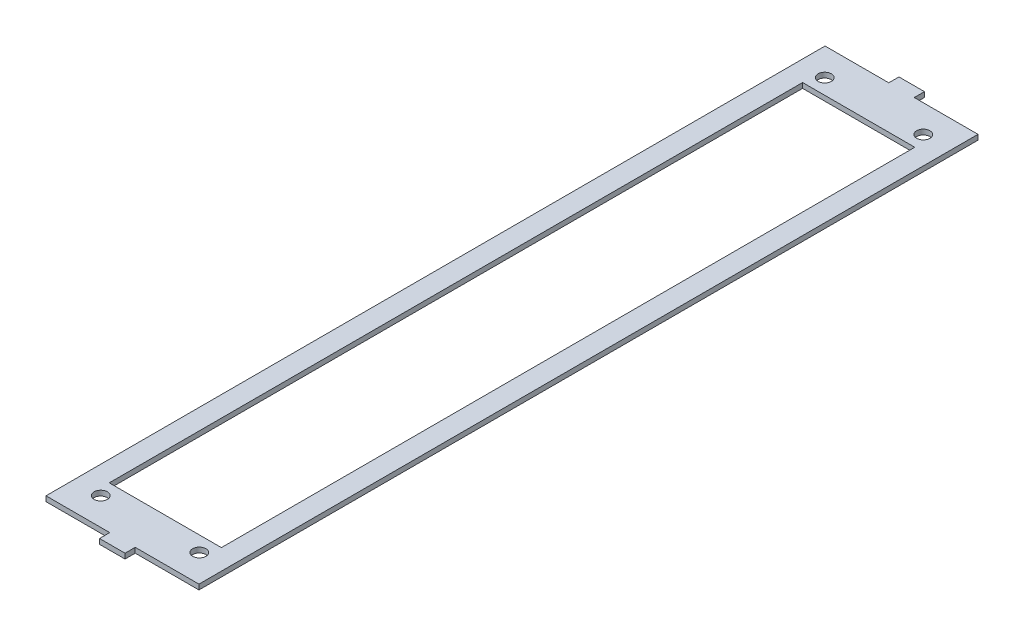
ISO-10303-21;
HEADER;
FILE_DESCRIPTION(('STEP AP214'),'2;1');
FILE_NAME('part.step','',(''),(''),'','','');
FILE_SCHEMA(('AUTOMOTIVE_DESIGN { 1 0 10303 214 1 1 1 1 }'));
ENDSEC;
DATA;
#1=APPLICATION_CONTEXT('core data for automotive mechanical design processes');
#2=APPLICATION_PROTOCOL_DEFINITION('international standard','automotive_design',2000,#1);
#3=PRODUCT_CONTEXT('',#1,'mechanical');
#4=PRODUCT('Part','Part','',(#3));
#5=PRODUCT_RELATED_PRODUCT_CATEGORY('part','',(#4));
#6=PRODUCT_DEFINITION_FORMATION('','',#4);
#7=PRODUCT_DEFINITION_CONTEXT('part definition',#1,'design');
#8=PRODUCT_DEFINITION('design','',#6,#7);
#9=PRODUCT_DEFINITION_SHAPE('','',#8);
#10=(LENGTH_UNIT() NAMED_UNIT(*) SI_UNIT(.MILLI.,.METRE.));
#11=(NAMED_UNIT(*) PLANE_ANGLE_UNIT() SI_UNIT($,.RADIAN.));
#12=(NAMED_UNIT(*) SI_UNIT($,.STERADIAN.) SOLID_ANGLE_UNIT());
#13=UNCERTAINTY_MEASURE_WITH_UNIT(LENGTH_MEASURE(1.E-05),#10,'distance_accuracy_value','');
#14=(GEOMETRIC_REPRESENTATION_CONTEXT(3) GLOBAL_UNCERTAINTY_ASSIGNED_CONTEXT((#13)) GLOBAL_UNIT_ASSIGNED_CONTEXT((#10,
#11,#12)) REPRESENTATION_CONTEXT('',''));
#15=CARTESIAN_POINT('',(0.,0.,0.));
#16=DIRECTION('',(0.,0.,1.));
#17=DIRECTION('',(1.,0.,0.));
#18=AXIS2_PLACEMENT_3D('',#15,#16,#17);
#19=CARTESIAN_POINT('',(0.,3.,0.));
#20=DIRECTION('',(0.,1.,0.));
#21=DIRECTION('',(0.,0.,1.));
#22=AXIS2_PLACEMENT_3D('',#19,#20,#21);
#23=PLANE('',#22);
#24=CARTESIAN_POINT('',(61.9999999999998,3.,417.));
#25=DIRECTION('',(0.,1.,0.));
#26=DIRECTION('',(0.,0.,1.));
#27=AXIS2_PLACEMENT_3D('',#24,#25,#26);
#28=CIRCLE('',#27,3.89999999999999);
#29=CARTESIAN_POINT('',(61.9999999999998,3.,420.9));
#30=VERTEX_POINT('',#29);
#31=EDGE_CURVE('E525',#30,#30,#28,.T.);
#32=ORIENTED_EDGE('',*,*,#31,.F.);
#33=EDGE_LOOP('',(#32));
#34=FACE_BOUND('',#33,.T.);
#35=CARTESIAN_POINT('',(4.00000000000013,3.,-9.));
#36=DIRECTION('',(0.,1.,0.));
#37=DIRECTION('',(0.,0.,1.));
#38=AXIS2_PLACEMENT_3D('',#35,#36,#37);
#39=CIRCLE('',#38,3.9);
#40=CARTESIAN_POINT('',(4.00000000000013,3.,-5.1));
#41=VERTEX_POINT('',#40);
#42=EDGE_CURVE('E175',#41,#41,#39,.T.);
#43=ORIENTED_EDGE('',*,*,#42,.F.);
#44=EDGE_LOOP('',(#43));
#45=FACE_BOUND('',#44,.T.);
#46=DIRECTION('',(-1.,0.,0.));
#47=VECTOR('',#46,1.);
#48=CARTESIAN_POINT('',(40.5,3.,-25.2));
#49=LINE('',#48,#47);
#50=CARTESIAN_POINT('',(78.,3.,-25.2));
#51=VERTEX_POINT('',#50);
#52=CARTESIAN_POINT('',(40.5,3.,-25.2));
#53=VERTEX_POINT('',#52);
#54=EDGE_CURVE('E185',#51,#53,#49,.T.);
#55=ORIENTED_EDGE('',*,*,#54,.T.);
#56=DIRECTION('',(0.,0.,-1.));
#57=VECTOR('',#56,1.);
#58=CARTESIAN_POINT('',(40.5,3.,-31.2));
#59=LINE('',#58,#57);
#60=CARTESIAN_POINT('',(40.5,3.,-31.2));
#61=VERTEX_POINT('',#60);
#62=EDGE_CURVE('E188',#53,#61,#59,.T.);
#63=ORIENTED_EDGE('',*,*,#62,.T.);
#64=DIRECTION('',(-1.,0.,0.));
#65=VECTOR('',#64,1.);
#66=CARTESIAN_POINT('',(25.5,3.,-31.2));
#67=LINE('',#66,#65);
#68=CARTESIAN_POINT('',(25.5,3.,-31.2));
#69=VERTEX_POINT('',#68);
#70=EDGE_CURVE('E191',#61,#69,#67,.T.);
#71=ORIENTED_EDGE('',*,*,#70,.T.);
#72=DIRECTION('',(0.,0.,1.));
#73=VECTOR('',#72,1.);
#74=CARTESIAN_POINT('',(25.5,3.,-31.2));
#75=LINE('',#74,#73);
#76=CARTESIAN_POINT('',(25.5,3.,-25.2));
#77=VERTEX_POINT('',#76);
#78=EDGE_CURVE('E193',#69,#77,#75,.T.);
#79=ORIENTED_EDGE('',*,*,#78,.T.);
#80=DIRECTION('',(-1.,0.,0.));
#81=VECTOR('',#80,1.);
#82=CARTESIAN_POINT('',(-12.,3.,-25.2));
#83=LINE('',#82,#81);
#84=CARTESIAN_POINT('',(-12.,3.,-25.2));
#85=VERTEX_POINT('',#84);
#86=EDGE_CURVE('E195',#77,#85,#83,.T.);
#87=ORIENTED_EDGE('',*,*,#86,.T.);
#88=DIRECTION('',(0.,0.,1.));
#89=VECTOR('',#88,1.);
#90=CARTESIAN_POINT('',(-12.,3.,433.2));
#91=LINE('',#90,#89);
#92=CARTESIAN_POINT('',(-12.,3.,433.2));
#93=VERTEX_POINT('',#92);
#94=EDGE_CURVE('E197',#85,#93,#91,.T.);
#95=ORIENTED_EDGE('',*,*,#94,.T.);
#96=DIRECTION('',(1.,0.,0.));
#97=VECTOR('',#96,1.);
#98=CARTESIAN_POINT('',(-12.,3.,433.2));
#99=LINE('',#98,#97);
#100=CARTESIAN_POINT('',(25.5,3.,433.2));
#101=VERTEX_POINT('',#100);
#102=EDGE_CURVE('E199',#93,#101,#99,.T.);
#103=ORIENTED_EDGE('',*,*,#102,.T.);
#104=DIRECTION('',(0.,0.,1.));
#105=VECTOR('',#104,1.);
#106=CARTESIAN_POINT('',(25.5,3.,439.2));
#107=LINE('',#106,#105);
#108=CARTESIAN_POINT('',(25.5,3.,439.2));
#109=VERTEX_POINT('',#108);
#110=EDGE_CURVE('E201',#101,#109,#107,.T.);
#111=ORIENTED_EDGE('',*,*,#110,.T.);
#112=DIRECTION('',(1.,0.,0.));
#113=VECTOR('',#112,1.);
#114=CARTESIAN_POINT('',(25.5,3.,439.2));
#115=LINE('',#114,#113);
#116=CARTESIAN_POINT('',(40.5,3.,439.2));
#117=VERTEX_POINT('',#116);
#118=EDGE_CURVE('E203',#109,#117,#115,.T.);
#119=ORIENTED_EDGE('',*,*,#118,.T.);
#120=DIRECTION('',(0.,0.,-1.));
#121=VECTOR('',#120,1.);
#122=CARTESIAN_POINT('',(40.5,3.,439.2));
#123=LINE('',#122,#121);
#124=CARTESIAN_POINT('',(40.5,3.,433.2));
#125=VERTEX_POINT('',#124);
#126=EDGE_CURVE('E205',#117,#125,#123,.T.);
#127=ORIENTED_EDGE('',*,*,#126,.T.);
#128=DIRECTION('',(1.,0.,0.));
#129=VECTOR('',#128,1.);
#130=CARTESIAN_POINT('',(40.5,3.,433.2));
#131=LINE('',#130,#129);
#132=CARTESIAN_POINT('',(78.,3.,433.2));
#133=VERTEX_POINT('',#132);
#134=EDGE_CURVE('E207',#125,#133,#131,.T.);
#135=ORIENTED_EDGE('',*,*,#134,.T.);
#136=DIRECTION('',(0.,0.,-1.));
#137=VECTOR('',#136,1.);
#138=CARTESIAN_POINT('',(78.,3.,433.2));
#139=LINE('',#138,#137);
#140=EDGE_CURVE('E209',#133,#51,#139,.T.);
#141=ORIENTED_EDGE('',*,*,#140,.T.);
#142=EDGE_LOOP('',(#55,#63,#71,#79,#87,#95,#103,#111,#119,#127,#135,#141));
#143=FACE_BOUND('',#142,.T.);
#144=DIRECTION('',(1.,0.,0.));
#145=VECTOR('',#144,1.);
#146=CARTESIAN_POINT('',(0.,3.,408.));
#147=LINE('',#146,#145);
#148=CARTESIAN_POINT('',(0.,3.,408.));
#149=VERTEX_POINT('',#148);
#150=CARTESIAN_POINT('',(66.0000000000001,3.,408.));
#151=VERTEX_POINT('',#150);
#152=EDGE_CURVE('E154',#149,#151,#147,.T.);
#153=ORIENTED_EDGE('',*,*,#152,.F.);
#154=DIRECTION('',(0.,0.,1.));
#155=VECTOR('',#154,1.);
#156=CARTESIAN_POINT('',(0.,3.,0.));
#157=LINE('',#156,#155);
#158=CARTESIAN_POINT('',(0.,3.,0.));
#159=VERTEX_POINT('',#158);
#160=EDGE_CURVE('E146',#159,#149,#157,.T.);
#161=ORIENTED_EDGE('',*,*,#160,.F.);
#162=DIRECTION('',(-1.,0.,0.));
#163=VECTOR('',#162,1.);
#164=CARTESIAN_POINT('',(0.,3.,0.));
#165=LINE('',#164,#163);
#166=CARTESIAN_POINT('',(66.,3.,0.));
#167=VERTEX_POINT('',#166);
#168=EDGE_CURVE('E169',#167,#159,#165,.T.);
#169=ORIENTED_EDGE('',*,*,#168,.F.);
#170=DIRECTION('',(0.,0.,-1.));
#171=VECTOR('',#170,1.);
#172=CARTESIAN_POINT('',(66.,3.,0.));
#173=LINE('',#172,#171);
#174=EDGE_CURVE('E167',#151,#167,#173,.T.);
#175=ORIENTED_EDGE('',*,*,#174,.F.);
#176=EDGE_LOOP('',(#153,#161,#169,#175));
#177=FACE_BOUND('',#176,.T.);
#178=CARTESIAN_POINT('',(61.9999999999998,3.,-9.));
#179=DIRECTION('',(0.,1.,0.));
#180=DIRECTION('',(0.,0.,-1.));
#181=AXIS2_PLACEMENT_3D('',#178,#179,#180);
#182=CIRCLE('',#181,3.9);
#183=CARTESIAN_POINT('',(61.9999999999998,3.,-12.9));
#184=VERTEX_POINT('',#183);
#185=EDGE_CURVE('E531',#184,#184,#182,.T.);
#186=ORIENTED_EDGE('',*,*,#185,.F.);
#187=EDGE_LOOP('',(#186));
#188=FACE_BOUND('',#187,.T.);
#189=CARTESIAN_POINT('',(4.00000000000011,3.,417.));
#190=DIRECTION('',(0.,1.,0.));
#191=DIRECTION('',(0.,0.,-1.));
#192=AXIS2_PLACEMENT_3D('',#189,#190,#191);
#193=CIRCLE('',#192,3.89999999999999);
#194=CARTESIAN_POINT('',(4.00000000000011,3.,413.1));
#195=VERTEX_POINT('',#194);
#196=EDGE_CURVE('E516',#195,#195,#193,.T.);
#197=ORIENTED_EDGE('',*,*,#196,.F.);
#198=EDGE_LOOP('',(#197));
#199=FACE_BOUND('',#198,.T.);
#200=ADVANCED_FACE('F33',(#34,#45,#143,#177,#188,#199),#23,.T.);
#201=CARTESIAN_POINT('',(0.,0.,0.));
#202=DIRECTION('',(0.,1.,0.));
#203=DIRECTION('',(0.,0.,1.));
#204=AXIS2_PLACEMENT_3D('',#201,#202,#203);
#205=PLANE('',#204);
#206=DIRECTION('',(-1.,0.,0.));
#207=VECTOR('',#206,1.);
#208=CARTESIAN_POINT('',(40.5,0.,-25.2));
#209=LINE('',#208,#207);
#210=CARTESIAN_POINT('',(78.,0.,-25.2));
#211=VERTEX_POINT('',#210);
#212=CARTESIAN_POINT('',(40.5,0.,-25.2));
#213=VERTEX_POINT('',#212);
#214=EDGE_CURVE('E162',#211,#213,#209,.T.);
#215=ORIENTED_EDGE('',*,*,#214,.F.);
#216=DIRECTION('',(0.,0.,-1.));
#217=VECTOR('',#216,1.);
#218=CARTESIAN_POINT('',(78.,0.,433.2));
#219=LINE('',#218,#217);
#220=CARTESIAN_POINT('',(78.,0.,433.2));
#221=VERTEX_POINT('',#220);
#222=EDGE_CURVE('E189',#221,#211,#219,.T.);
#223=ORIENTED_EDGE('',*,*,#222,.F.);
#224=DIRECTION('',(1.,0.,0.));
#225=VECTOR('',#224,1.);
#226=CARTESIAN_POINT('',(40.5,0.,433.2));
#227=LINE('',#226,#225);
#228=CARTESIAN_POINT('',(40.5,0.,433.2));
#229=VERTEX_POINT('',#228);
#230=EDGE_CURVE('E232',#229,#221,#227,.T.);
#231=ORIENTED_EDGE('',*,*,#230,.F.);
#232=DIRECTION('',(0.,0.,-1.));
#233=VECTOR('',#232,1.);
#234=CARTESIAN_POINT('',(40.5,0.,439.2));
#235=LINE('',#234,#233);
#236=CARTESIAN_POINT('',(40.5,0.,439.2));
#237=VERTEX_POINT('',#236);
#238=EDGE_CURVE('E230',#237,#229,#235,.T.);
#239=ORIENTED_EDGE('',*,*,#238,.F.);
#240=DIRECTION('',(1.,0.,0.));
#241=VECTOR('',#240,1.);
#242=CARTESIAN_POINT('',(25.5,0.,439.2));
#243=LINE('',#242,#241);
#244=CARTESIAN_POINT('',(25.5,0.,439.2));
#245=VERTEX_POINT('',#244);
#246=EDGE_CURVE('E228',#245,#237,#243,.T.);
#247=ORIENTED_EDGE('',*,*,#246,.F.);
#248=DIRECTION('',(0.,0.,1.));
#249=VECTOR('',#248,1.);
#250=CARTESIAN_POINT('',(25.5,0.,439.2));
#251=LINE('',#250,#249);
#252=CARTESIAN_POINT('',(25.5,0.,433.2));
#253=VERTEX_POINT('',#252);
#254=EDGE_CURVE('E226',#253,#245,#251,.T.);
#255=ORIENTED_EDGE('',*,*,#254,.F.);
#256=DIRECTION('',(1.,0.,0.));
#257=VECTOR('',#256,1.);
#258=CARTESIAN_POINT('',(-12.,0.,433.2));
#259=LINE('',#258,#257);
#260=CARTESIAN_POINT('',(-12.,0.,433.2));
#261=VERTEX_POINT('',#260);
#262=EDGE_CURVE('E224',#261,#253,#259,.T.);
#263=ORIENTED_EDGE('',*,*,#262,.F.);
#264=DIRECTION('',(0.,0.,1.));
#265=VECTOR('',#264,1.);
#266=CARTESIAN_POINT('',(-12.,0.,433.2));
#267=LINE('',#266,#265);
#268=CARTESIAN_POINT('',(-12.,0.,-25.2));
#269=VERTEX_POINT('',#268);
#270=EDGE_CURVE('E222',#269,#261,#267,.T.);
#271=ORIENTED_EDGE('',*,*,#270,.F.);
#272=DIRECTION('',(-1.,0.,0.));
#273=VECTOR('',#272,1.);
#274=CARTESIAN_POINT('',(-12.,0.,-25.2));
#275=LINE('',#274,#273);
#276=CARTESIAN_POINT('',(25.5,0.,-25.2));
#277=VERTEX_POINT('',#276);
#278=EDGE_CURVE('E220',#277,#269,#275,.T.);
#279=ORIENTED_EDGE('',*,*,#278,.F.);
#280=DIRECTION('',(0.,0.,1.));
#281=VECTOR('',#280,1.);
#282=CARTESIAN_POINT('',(25.5,0.,-31.2));
#283=LINE('',#282,#281);
#284=CARTESIAN_POINT('',(25.5,0.,-31.2));
#285=VERTEX_POINT('',#284);
#286=EDGE_CURVE('E218',#285,#277,#283,.T.);
#287=ORIENTED_EDGE('',*,*,#286,.F.);
#288=DIRECTION('',(-1.,0.,0.));
#289=VECTOR('',#288,1.);
#290=CARTESIAN_POINT('',(25.5,0.,-31.2));
#291=LINE('',#290,#289);
#292=CARTESIAN_POINT('',(40.5,0.,-31.2));
#293=VERTEX_POINT('',#292);
#294=EDGE_CURVE('E216',#293,#285,#291,.T.);
#295=ORIENTED_EDGE('',*,*,#294,.F.);
#296=DIRECTION('',(0.,0.,-1.));
#297=VECTOR('',#296,1.);
#298=CARTESIAN_POINT('',(40.5,0.,-31.2));
#299=LINE('',#298,#297);
#300=EDGE_CURVE('E214',#213,#293,#299,.T.);
#301=ORIENTED_EDGE('',*,*,#300,.F.);
#302=EDGE_LOOP('',(#215,#223,#231,#239,#247,#255,#263,#271,#279,#287,#295,#301));
#303=FACE_BOUND('',#302,.T.);
#304=DIRECTION('',(0.,0.,1.));
#305=VECTOR('',#304,1.);
#306=CARTESIAN_POINT('',(0.,0.,0.));
#307=LINE('',#306,#305);
#308=CARTESIAN_POINT('',(0.,0.,0.));
#309=VERTEX_POINT('',#308);
#310=CARTESIAN_POINT('',(0.,0.,408.));
#311=VERTEX_POINT('',#310);
#312=EDGE_CURVE('E56',#309,#311,#307,.T.);
#313=ORIENTED_EDGE('',*,*,#312,.T.);
#314=DIRECTION('',(1.,0.,0.));
#315=VECTOR('',#314,1.);
#316=CARTESIAN_POINT('',(0.,0.,408.));
#317=LINE('',#316,#315);
#318=CARTESIAN_POINT('',(66.0000000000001,0.,408.));
#319=VERTEX_POINT('',#318);
#320=EDGE_CURVE('E161',#311,#319,#317,.T.);
#321=ORIENTED_EDGE('',*,*,#320,.T.);
#322=DIRECTION('',(0.,0.,-1.));
#323=VECTOR('',#322,1.);
#324=CARTESIAN_POINT('',(66.,0.,0.));
#325=LINE('',#324,#323);
#326=CARTESIAN_POINT('',(66.,0.,0.));
#327=VERTEX_POINT('',#326);
#328=EDGE_CURVE('E177',#319,#327,#325,.T.);
#329=ORIENTED_EDGE('',*,*,#328,.T.);
#330=DIRECTION('',(-1.,0.,0.));
#331=VECTOR('',#330,1.);
#332=CARTESIAN_POINT('',(0.,0.,0.));
#333=LINE('',#332,#331);
#334=EDGE_CURVE('E155',#327,#309,#333,.T.);
#335=ORIENTED_EDGE('',*,*,#334,.T.);
#336=EDGE_LOOP('',(#313,#321,#329,#335));
#337=FACE_BOUND('',#336,.T.);
#338=CARTESIAN_POINT('',(4.00000000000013,0.,-9.));
#339=DIRECTION('',(0.,1.,0.));
#340=DIRECTION('',(0.,0.,1.));
#341=AXIS2_PLACEMENT_3D('',#338,#339,#340);
#342=CIRCLE('',#341,3.9);
#343=CARTESIAN_POINT('',(4.00000000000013,0.,-5.1));
#344=VERTEX_POINT('',#343);
#345=EDGE_CURVE('E534',#344,#344,#342,.T.);
#346=ORIENTED_EDGE('',*,*,#345,.T.);
#347=EDGE_LOOP('',(#346));
#348=FACE_BOUND('',#347,.T.);
#349=CARTESIAN_POINT('',(61.9999999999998,0.,-9.));
#350=DIRECTION('',(0.,1.,0.));
#351=DIRECTION('',(0.,0.,-1.));
#352=AXIS2_PLACEMENT_3D('',#349,#350,#351);
#353=CIRCLE('',#352,3.9);
#354=CARTESIAN_POINT('',(61.9999999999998,0.,-12.9));
#355=VERTEX_POINT('',#354);
#356=EDGE_CURVE('E528',#355,#355,#353,.T.);
#357=ORIENTED_EDGE('',*,*,#356,.T.);
#358=EDGE_LOOP('',(#357));
#359=FACE_BOUND('',#358,.T.);
#360=CARTESIAN_POINT('',(61.9999999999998,0.,417.));
#361=DIRECTION('',(0.,1.,0.));
#362=DIRECTION('',(0.,0.,1.));
#363=AXIS2_PLACEMENT_3D('',#360,#361,#362);
#364=CIRCLE('',#363,3.89999999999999);
#365=CARTESIAN_POINT('',(61.9999999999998,0.,420.9));
#366=VERTEX_POINT('',#365);
#367=EDGE_CURVE('E522',#366,#366,#364,.T.);
#368=ORIENTED_EDGE('',*,*,#367,.T.);
#369=EDGE_LOOP('',(#368));
#370=FACE_BOUND('',#369,.T.);
#371=CARTESIAN_POINT('',(4.00000000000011,0.,417.));
#372=DIRECTION('',(0.,1.,0.));
#373=DIRECTION('',(0.,0.,-1.));
#374=AXIS2_PLACEMENT_3D('',#371,#372,#373);
#375=CIRCLE('',#374,3.89999999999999);
#376=CARTESIAN_POINT('',(4.00000000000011,0.,413.1));
#377=VERTEX_POINT('',#376);
#378=EDGE_CURVE('E519',#377,#377,#375,.T.);
#379=ORIENTED_EDGE('',*,*,#378,.T.);
#380=EDGE_LOOP('',(#379));
#381=FACE_BOUND('',#380,.T.);
#382=ADVANCED_FACE('F274',(#303,#337,#348,#359,#370,#381),#205,.F.);
#383=CARTESIAN_POINT('',(40.5,3.,-25.2));
#384=DIRECTION('',(0.,0.,1.));
#385=DIRECTION('',(1.,0.,0.));
#386=AXIS2_PLACEMENT_3D('',#383,#384,#385);
#387=PLANE('',#386);
#388=ORIENTED_EDGE('',*,*,#214,.T.);
#389=DIRECTION('',(0.,-1.,0.));
#390=VECTOR('',#389,1.);
#391=CARTESIAN_POINT('',(40.5,3.,-25.2));
#392=LINE('',#391,#390);
#393=EDGE_CURVE('E11',#53,#213,#392,.T.);
#394=ORIENTED_EDGE('',*,*,#393,.F.);
#395=ORIENTED_EDGE('',*,*,#54,.F.);
#396=DIRECTION('',(0.,-1.,0.));
#397=VECTOR('',#396,1.);
#398=CARTESIAN_POINT('',(78.,3.,-25.2));
#399=LINE('',#398,#397);
#400=EDGE_CURVE('E211',#51,#211,#399,.T.);
#401=ORIENTED_EDGE('',*,*,#400,.T.);
#402=EDGE_LOOP('',(#388,#394,#395,#401));
#403=FACE_BOUND('',#402,.T.);
#404=ADVANCED_FACE('F35',(#403),#387,.F.);
#405=CARTESIAN_POINT('',(40.5,3.,-31.2));
#406=DIRECTION('',(-1.,0.,0.));
#407=DIRECTION('',(0.,0.,1.));
#408=AXIS2_PLACEMENT_3D('',#405,#406,#407);
#409=PLANE('',#408);
#410=ORIENTED_EDGE('',*,*,#300,.T.);
#411=DIRECTION('',(0.,-1.,0.));
#412=VECTOR('',#411,1.);
#413=CARTESIAN_POINT('',(40.5,3.,-31.2));
#414=LINE('',#413,#412);
#415=EDGE_CURVE('E41',#61,#293,#414,.T.);
#416=ORIENTED_EDGE('',*,*,#415,.F.);
#417=ORIENTED_EDGE('',*,*,#62,.F.);
#418=ORIENTED_EDGE('',*,*,#393,.T.);
#419=EDGE_LOOP('',(#410,#416,#417,#418));
#420=FACE_BOUND('',#419,.T.);
#421=ADVANCED_FACE('F291',(#420),#409,.F.);
#422=CARTESIAN_POINT('',(25.5,3.,-31.2));
#423=DIRECTION('',(0.,0.,1.));
#424=DIRECTION('',(1.,0.,0.));
#425=AXIS2_PLACEMENT_3D('',#422,#423,#424);
#426=PLANE('',#425);
#427=ORIENTED_EDGE('',*,*,#294,.T.);
#428=DIRECTION('',(0.,-1.,0.));
#429=VECTOR('',#428,1.);
#430=CARTESIAN_POINT('',(25.5,3.,-31.2));
#431=LINE('',#430,#429);
#432=EDGE_CURVE('E261',#69,#285,#431,.T.);
#433=ORIENTED_EDGE('',*,*,#432,.F.);
#434=ORIENTED_EDGE('',*,*,#70,.F.);
#435=ORIENTED_EDGE('',*,*,#415,.T.);
#436=EDGE_LOOP('',(#427,#433,#434,#435));
#437=FACE_BOUND('',#436,.T.);
#438=ADVANCED_FACE('F268',(#437),#426,.F.);
#439=CARTESIAN_POINT('',(25.5,3.,-31.2));
#440=DIRECTION('',(1.,0.,0.));
#441=DIRECTION('',(0.,0.,-1.));
#442=AXIS2_PLACEMENT_3D('',#439,#440,#441);
#443=PLANE('',#442);
#444=ORIENTED_EDGE('',*,*,#286,.T.);
#445=DIRECTION('',(0.,-1.,0.));
#446=VECTOR('',#445,1.);
#447=CARTESIAN_POINT('',(25.5,3.,-25.2));
#448=LINE('',#447,#446);
#449=EDGE_CURVE('E258',#77,#277,#448,.T.);
#450=ORIENTED_EDGE('',*,*,#449,.F.);
#451=ORIENTED_EDGE('',*,*,#78,.F.);
#452=ORIENTED_EDGE('',*,*,#432,.T.);
#453=EDGE_LOOP('',(#444,#450,#451,#452));
#454=FACE_BOUND('',#453,.T.);
#455=ADVANCED_FACE('F280',(#454),#443,.F.);
#456=CARTESIAN_POINT('',(-12.,3.,-25.2));
#457=DIRECTION('',(0.,0.,1.));
#458=DIRECTION('',(1.,0.,0.));
#459=AXIS2_PLACEMENT_3D('',#456,#457,#458);
#460=PLANE('',#459);
#461=ORIENTED_EDGE('',*,*,#278,.T.);
#462=DIRECTION('',(0.,-1.,0.));
#463=VECTOR('',#462,1.);
#464=CARTESIAN_POINT('',(-12.,3.,-25.2));
#465=LINE('',#464,#463);
#466=EDGE_CURVE('E255',#85,#269,#465,.T.);
#467=ORIENTED_EDGE('',*,*,#466,.F.);
#468=ORIENTED_EDGE('',*,*,#86,.F.);
#469=ORIENTED_EDGE('',*,*,#449,.T.);
#470=EDGE_LOOP('',(#461,#467,#468,#469));
#471=FACE_BOUND('',#470,.T.);
#472=ADVANCED_FACE('F284',(#471),#460,.F.);
#473=CARTESIAN_POINT('',(-12.,3.,433.2));
#474=DIRECTION('',(1.,0.,0.));
#475=DIRECTION('',(0.,0.,-1.));
#476=AXIS2_PLACEMENT_3D('',#473,#474,#475);
#477=PLANE('',#476);
#478=ORIENTED_EDGE('',*,*,#270,.T.);
#479=DIRECTION('',(0.,-1.,0.));
#480=VECTOR('',#479,1.);
#481=CARTESIAN_POINT('',(-12.,3.,433.2));
#482=LINE('',#481,#480);
#483=EDGE_CURVE('E252',#93,#261,#482,.T.);
#484=ORIENTED_EDGE('',*,*,#483,.F.);
#485=ORIENTED_EDGE('',*,*,#94,.F.);
#486=ORIENTED_EDGE('',*,*,#466,.T.);
#487=EDGE_LOOP('',(#478,#484,#485,#486));
#488=FACE_BOUND('',#487,.T.);
#489=ADVANCED_FACE('F324',(#488),#477,.F.);
#490=CARTESIAN_POINT('',(-12.,3.,433.2));
#491=DIRECTION('',(0.,0.,-1.));
#492=DIRECTION('',(-1.,0.,0.));
#493=AXIS2_PLACEMENT_3D('',#490,#491,#492);
#494=PLANE('',#493);
#495=ORIENTED_EDGE('',*,*,#262,.T.);
#496=DIRECTION('',(0.,-1.,0.));
#497=VECTOR('',#496,1.);
#498=CARTESIAN_POINT('',(25.5,3.,433.2));
#499=LINE('',#498,#497);
#500=EDGE_CURVE('E249',#101,#253,#499,.T.);
#501=ORIENTED_EDGE('',*,*,#500,.F.);
#502=ORIENTED_EDGE('',*,*,#102,.F.);
#503=ORIENTED_EDGE('',*,*,#483,.T.);
#504=EDGE_LOOP('',(#495,#501,#502,#503));
#505=FACE_BOUND('',#504,.T.);
#506=ADVANCED_FACE('F322',(#505),#494,.F.);
#507=CARTESIAN_POINT('',(25.5,3.,439.2));
#508=DIRECTION('',(1.,0.,0.));
#509=DIRECTION('',(0.,0.,-1.));
#510=AXIS2_PLACEMENT_3D('',#507,#508,#509);
#511=PLANE('',#510);
#512=ORIENTED_EDGE('',*,*,#254,.T.);
#513=DIRECTION('',(0.,-1.,0.));
#514=VECTOR('',#513,1.);
#515=CARTESIAN_POINT('',(25.5,3.,439.2));
#516=LINE('',#515,#514);
#517=EDGE_CURVE('E246',#109,#245,#516,.T.);
#518=ORIENTED_EDGE('',*,*,#517,.F.);
#519=ORIENTED_EDGE('',*,*,#110,.F.);
#520=ORIENTED_EDGE('',*,*,#500,.T.);
#521=EDGE_LOOP('',(#512,#518,#519,#520));
#522=FACE_BOUND('',#521,.T.);
#523=ADVANCED_FACE('F318',(#522),#511,.F.);
#524=CARTESIAN_POINT('',(25.5,3.,439.2));
#525=DIRECTION('',(0.,0.,-1.));
#526=DIRECTION('',(-1.,0.,0.));
#527=AXIS2_PLACEMENT_3D('',#524,#525,#526);
#528=PLANE('',#527);
#529=ORIENTED_EDGE('',*,*,#246,.T.);
#530=DIRECTION('',(0.,-1.,0.));
#531=VECTOR('',#530,1.);
#532=CARTESIAN_POINT('',(40.5,3.,439.2));
#533=LINE('',#532,#531);
#534=EDGE_CURVE('E243',#117,#237,#533,.T.);
#535=ORIENTED_EDGE('',*,*,#534,.F.);
#536=ORIENTED_EDGE('',*,*,#118,.F.);
#537=ORIENTED_EDGE('',*,*,#517,.T.);
#538=EDGE_LOOP('',(#529,#535,#536,#537));
#539=FACE_BOUND('',#538,.T.);
#540=ADVANCED_FACE('F313',(#539),#528,.F.);
#541=CARTESIAN_POINT('',(40.5,3.,439.2));
#542=DIRECTION('',(-1.,0.,0.));
#543=DIRECTION('',(0.,0.,1.));
#544=AXIS2_PLACEMENT_3D('',#541,#542,#543);
#545=PLANE('',#544);
#546=ORIENTED_EDGE('',*,*,#238,.T.);
#547=DIRECTION('',(0.,-1.,0.));
#548=VECTOR('',#547,1.);
#549=CARTESIAN_POINT('',(40.5,3.,433.2));
#550=LINE('',#549,#548);
#551=EDGE_CURVE('E240',#125,#229,#550,.T.);
#552=ORIENTED_EDGE('',*,*,#551,.F.);
#553=ORIENTED_EDGE('',*,*,#126,.F.);
#554=ORIENTED_EDGE('',*,*,#534,.T.);
#555=EDGE_LOOP('',(#546,#552,#553,#554));
#556=FACE_BOUND('',#555,.T.);
#557=ADVANCED_FACE('F307',(#556),#545,.F.);
#558=CARTESIAN_POINT('',(40.5,3.,433.2));
#559=DIRECTION('',(0.,0.,-1.));
#560=DIRECTION('',(-1.,0.,0.));
#561=AXIS2_PLACEMENT_3D('',#558,#559,#560);
#562=PLANE('',#561);
#563=ORIENTED_EDGE('',*,*,#230,.T.);
#564=DIRECTION('',(0.,-1.,0.));
#565=VECTOR('',#564,1.);
#566=CARTESIAN_POINT('',(78.,3.,433.2));
#567=LINE('',#566,#565);
#568=EDGE_CURVE('E237',#133,#221,#567,.T.);
#569=ORIENTED_EDGE('',*,*,#568,.F.);
#570=ORIENTED_EDGE('',*,*,#134,.F.);
#571=ORIENTED_EDGE('',*,*,#551,.T.);
#572=EDGE_LOOP('',(#563,#569,#570,#571));
#573=FACE_BOUND('',#572,.T.);
#574=ADVANCED_FACE('F303',(#573),#562,.F.);
#575=CARTESIAN_POINT('',(78.,3.,433.2));
#576=DIRECTION('',(-1.,0.,0.));
#577=DIRECTION('',(0.,0.,1.));
#578=AXIS2_PLACEMENT_3D('',#575,#576,#577);
#579=PLANE('',#578);
#580=ORIENTED_EDGE('',*,*,#222,.T.);
#581=ORIENTED_EDGE('',*,*,#400,.F.);
#582=ORIENTED_EDGE('',*,*,#140,.F.);
#583=ORIENTED_EDGE('',*,*,#568,.T.);
#584=EDGE_LOOP('',(#580,#581,#582,#583));
#585=FACE_BOUND('',#584,.T.);
#586=ADVANCED_FACE('F298',(#585),#579,.F.);
#587=CARTESIAN_POINT('',(0.,3.,0.));
#588=DIRECTION('',(1.,0.,0.));
#589=DIRECTION('',(0.,0.,-1.));
#590=AXIS2_PLACEMENT_3D('',#587,#588,#589);
#591=PLANE('',#590);
#592=ORIENTED_EDGE('',*,*,#312,.F.);
#593=DIRECTION('',(0.,-1.,0.));
#594=VECTOR('',#593,1.);
#595=CARTESIAN_POINT('',(0.,3.,0.));
#596=LINE('',#595,#594);
#597=EDGE_CURVE('E150',#159,#309,#596,.T.);
#598=ORIENTED_EDGE('',*,*,#597,.F.);
#599=ORIENTED_EDGE('',*,*,#160,.T.);
#600=DIRECTION('',(0.,-1.,0.));
#601=VECTOR('',#600,1.);
#602=CARTESIAN_POINT('',(0.,3.,408.));
#603=LINE('',#602,#601);
#604=EDGE_CURVE('E149',#149,#311,#603,.T.);
#605=ORIENTED_EDGE('',*,*,#604,.T.);
#606=EDGE_LOOP('',(#592,#598,#599,#605));
#607=FACE_BOUND('',#606,.T.);
#608=ADVANCED_FACE('F148',(#607),#591,.T.);
#609=CARTESIAN_POINT('',(0.,3.,408.));
#610=DIRECTION('',(0.,0.,-1.));
#611=DIRECTION('',(-1.,0.,0.));
#612=AXIS2_PLACEMENT_3D('',#609,#610,#611);
#613=PLANE('',#612);
#614=ORIENTED_EDGE('',*,*,#320,.F.);
#615=ORIENTED_EDGE('',*,*,#604,.F.);
#616=ORIENTED_EDGE('',*,*,#152,.T.);
#617=DIRECTION('',(0.,-1.,0.));
#618=VECTOR('',#617,1.);
#619=CARTESIAN_POINT('',(66.0000000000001,3.,408.));
#620=LINE('',#619,#618);
#621=EDGE_CURVE('E163',#151,#319,#620,.T.);
#622=ORIENTED_EDGE('',*,*,#621,.T.);
#623=EDGE_LOOP('',(#614,#615,#616,#622));
#624=FACE_BOUND('',#623,.T.);
#625=ADVANCED_FACE('F158',(#624),#613,.T.);
#626=CARTESIAN_POINT('',(66.,3.,0.));
#627=DIRECTION('',(-1.,0.,0.));
#628=DIRECTION('',(0.,0.,1.));
#629=AXIS2_PLACEMENT_3D('',#626,#627,#628);
#630=PLANE('',#629);
#631=ORIENTED_EDGE('',*,*,#328,.F.);
#632=ORIENTED_EDGE('',*,*,#621,.F.);
#633=ORIENTED_EDGE('',*,*,#174,.T.);
#634=DIRECTION('',(0.,-1.,0.));
#635=VECTOR('',#634,1.);
#636=CARTESIAN_POINT('',(66.,3.,0.));
#637=LINE('',#636,#635);
#638=EDGE_CURVE('E48',#167,#327,#637,.T.);
#639=ORIENTED_EDGE('',*,*,#638,.T.);
#640=EDGE_LOOP('',(#631,#632,#633,#639));
#641=FACE_BOUND('',#640,.T.);
#642=ADVANCED_FACE('F385',(#641),#630,.T.);
#643=CARTESIAN_POINT('',(0.,3.,0.));
#644=DIRECTION('',(0.,0.,1.));
#645=DIRECTION('',(1.,0.,0.));
#646=AXIS2_PLACEMENT_3D('',#643,#644,#645);
#647=PLANE('',#646);
#648=ORIENTED_EDGE('',*,*,#334,.F.);
#649=ORIENTED_EDGE('',*,*,#638,.F.);
#650=ORIENTED_EDGE('',*,*,#168,.T.);
#651=ORIENTED_EDGE('',*,*,#597,.T.);
#652=EDGE_LOOP('',(#648,#649,#650,#651));
#653=FACE_BOUND('',#652,.T.);
#654=ADVANCED_FACE('F391',(#653),#647,.T.);
#655=CARTESIAN_POINT('',(4.00000000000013,3.,-9.));
#656=DIRECTION('',(0.,-1.,0.));
#657=DIRECTION('',(0.,0.,-1.));
#658=AXIS2_PLACEMENT_3D('',#655,#656,#657);
#659=CYLINDRICAL_SURFACE('',#658,3.9);
#660=ORIENTED_EDGE('',*,*,#42,.T.);
#661=EDGE_LOOP('',(#660));
#662=FACE_BOUND('',#661,.T.);
#663=ORIENTED_EDGE('',*,*,#345,.F.);
#664=EDGE_LOOP('',(#663));
#665=FACE_BOUND('',#664,.T.);
#666=ADVANCED_FACE('F399',(#662,#665),#659,.F.);
#667=CARTESIAN_POINT('',(61.9999999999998,3.,-9.));
#668=DIRECTION('',(0.,-1.,0.));
#669=DIRECTION('',(0.,0.,-1.));
#670=AXIS2_PLACEMENT_3D('',#667,#668,#669);
#671=CYLINDRICAL_SURFACE('',#670,3.9);
#672=ORIENTED_EDGE('',*,*,#185,.T.);
#673=EDGE_LOOP('',(#672));
#674=FACE_BOUND('',#673,.T.);
#675=ORIENTED_EDGE('',*,*,#356,.F.);
#676=EDGE_LOOP('',(#675));
#677=FACE_BOUND('',#676,.T.);
#678=ADVANCED_FACE('F406',(#674,#677),#671,.F.);
#679=CARTESIAN_POINT('',(61.9999999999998,3.,417.));
#680=DIRECTION('',(0.,-1.,0.));
#681=DIRECTION('',(0.,0.,-1.));
#682=AXIS2_PLACEMENT_3D('',#679,#680,#681);
#683=CYLINDRICAL_SURFACE('',#682,3.89999999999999);
#684=ORIENTED_EDGE('',*,*,#31,.T.);
#685=EDGE_LOOP('',(#684));
#686=FACE_BOUND('',#685,.T.);
#687=ORIENTED_EDGE('',*,*,#367,.F.);
#688=EDGE_LOOP('',(#687));
#689=FACE_BOUND('',#688,.T.);
#690=ADVANCED_FACE('F414',(#686,#689),#683,.F.);
#691=CARTESIAN_POINT('',(4.00000000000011,3.,417.));
#692=DIRECTION('',(0.,-1.,0.));
#693=DIRECTION('',(0.,0.,-1.));
#694=AXIS2_PLACEMENT_3D('',#691,#692,#693);
#695=CYLINDRICAL_SURFACE('',#694,3.89999999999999);
#696=ORIENTED_EDGE('',*,*,#196,.T.);
#697=EDGE_LOOP('',(#696));
#698=FACE_BOUND('',#697,.T.);
#699=ORIENTED_EDGE('',*,*,#378,.F.);
#700=EDGE_LOOP('',(#699));
#701=FACE_BOUND('',#700,.T.);
#702=ADVANCED_FACE('F422',(#698,#701),#695,.F.);
#703=CLOSED_SHELL('',(#200,#382,#404,#421,#438,#455,#472,#489,#506,#523,#540,#557,#574,#586,
#608,#625,#642,#654,#666,#678,#690,#702));
#704=MANIFOLD_SOLID_BREP('B2',#703);
#705=ADVANCED_BREP_SHAPE_REPRESENTATION('',(#18,#704),#14);
#706=SHAPE_DEFINITION_REPRESENTATION(#9,#705);
ENDSEC;
END-ISO-10303-21;
